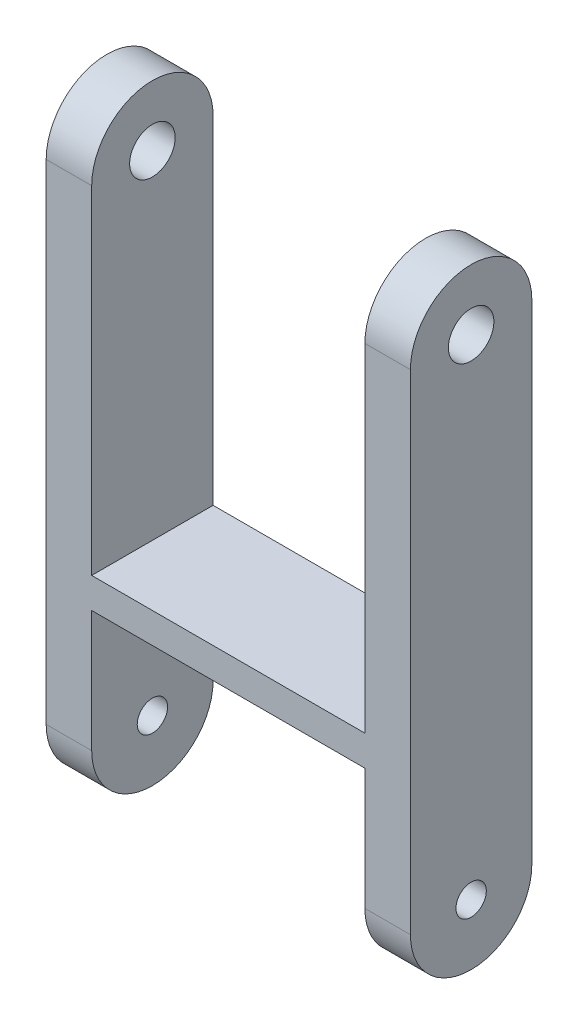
from build123d import *

# Parameters (mm, degrees)
SKETCH1_R          = 9.525
SKETCH1_R_2        = 6.35
EXTRUDE1_DEPTH     = 76.2
SKETCH2_W          = 114.3
SKETCH2_H          = 166.61641791
SKETCH2_H_2        = 76.2
CUT_EXTRUDE1_DEPTH = 158.191729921


with BuildPart() as part:
    # Sketch1 → Extrude1 (new, symmetric)
    with BuildSketch(Plane(origin=(0, 0, 0), x_dir=(0, 0, -1), z_dir=(1, 0, 0))):
        with BuildLine():
            Line((-25.4, 102.358208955), (-25.4, -102.358208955))
            ThreePointArc((-25.4, -102.358208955), (0, -127.758208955), (25.4, -102.358208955))
            Line((25.4, -102.358208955), (25.4, 102.358208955))
            ThreePointArc((25.4, 102.358208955), (0, 127.758208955), (-25.4, 102.358208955))
        make_face()
        with Locations(Location((0, 102.358208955, 0), (0, 0, 180))):
            Circle(SKETCH1_R, mode=Mode.SUBTRACT)
        with Locations(Location((0, -102.358208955, 0), (0, 0, 180))):
            Circle(SKETCH1_R_2, mode=Mode.SUBTRACT)
    extrude(amount=EXTRUDE1_DEPTH, both=True)

    # Sketch2 → Cut-Extrude1 (cut, through all)
    with BuildSketch(Plane.XY.offset(25.4)):
        with Locations((0, 44.45)):
            Rectangle(SKETCH2_W, SKETCH2_H)
        with Locations((0, -89.658208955)):
            Rectangle(SKETCH2_W, SKETCH2_H_2)
    extrude(amount=-CUT_EXTRUDE1_DEPTH, mode=Mode.SUBTRACT)


solid = part.part
